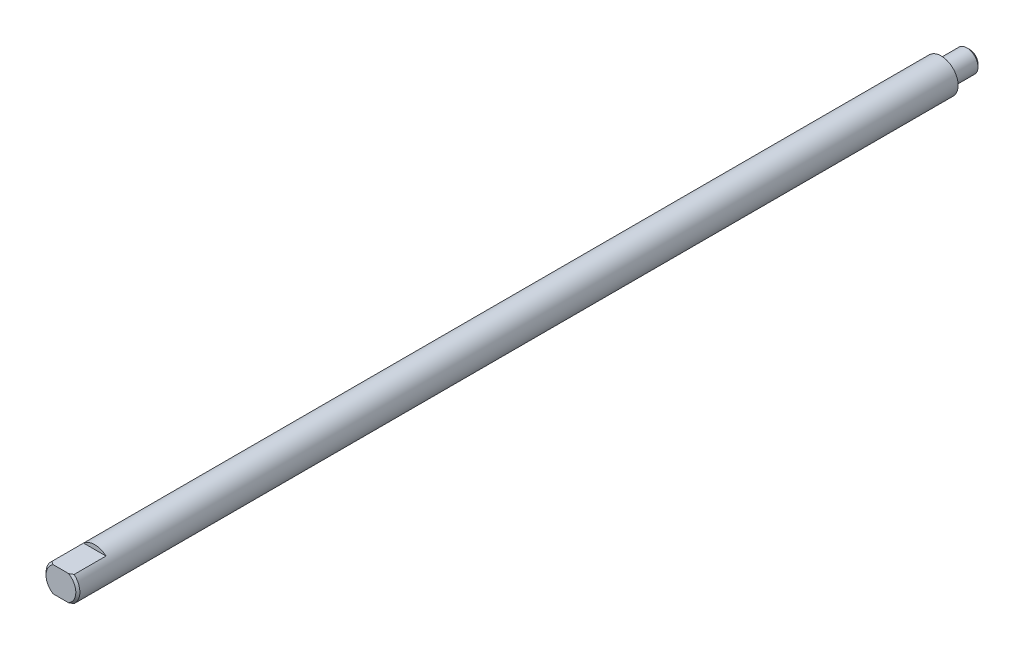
from build123d import *

# Parameters (mm, degrees)
SKETCH2_W          = 6.35
SKETCH2_H          = 0.8
CUT_EXTRUDE1_DEPTH = 5


with BuildPart() as part:
    # Sketch1 → Revolve1 (revolve)
    with BuildSketch(Plane(origin=(0, 0, 0), x_dir=(0, 0, -1), z_dir=(1, 0, 0)), mode=Mode.PRIVATE) as revolve1_sk:
        Polygon((166.366, 1.5728), (165.856, 2.0828), (161.036, 2.0828), (161.036, 3.175), (-3.684, 3.175), (-4.064, 2.79), (-4.064, 0), (166.366, 0), align=None)
    revolve(revolve1_sk.sketch.rotate(Axis((0, 0, 4.064), (0, 0, -1)), 90), axis=Axis((0, 0, 4.064), (0, 0, -1)))

    # Sketch2 → Cut-Extrude1 (cut, symmetric)
    with BuildSketch(Plane(origin=(0, 0, 0), x_dir=(0, 0, -1), z_dir=(1, 0, 0))):
        with Locations((-0.889, 2.775)):
            Rectangle(SKETCH2_W, SKETCH2_H)
        with Locations((-0.889, -2.775)):
            Rectangle(SKETCH2_W, SKETCH2_H)
    extrude(amount=CUT_EXTRUDE1_DEPTH, both=True, mode=Mode.SUBTRACT)


solid = part.part
